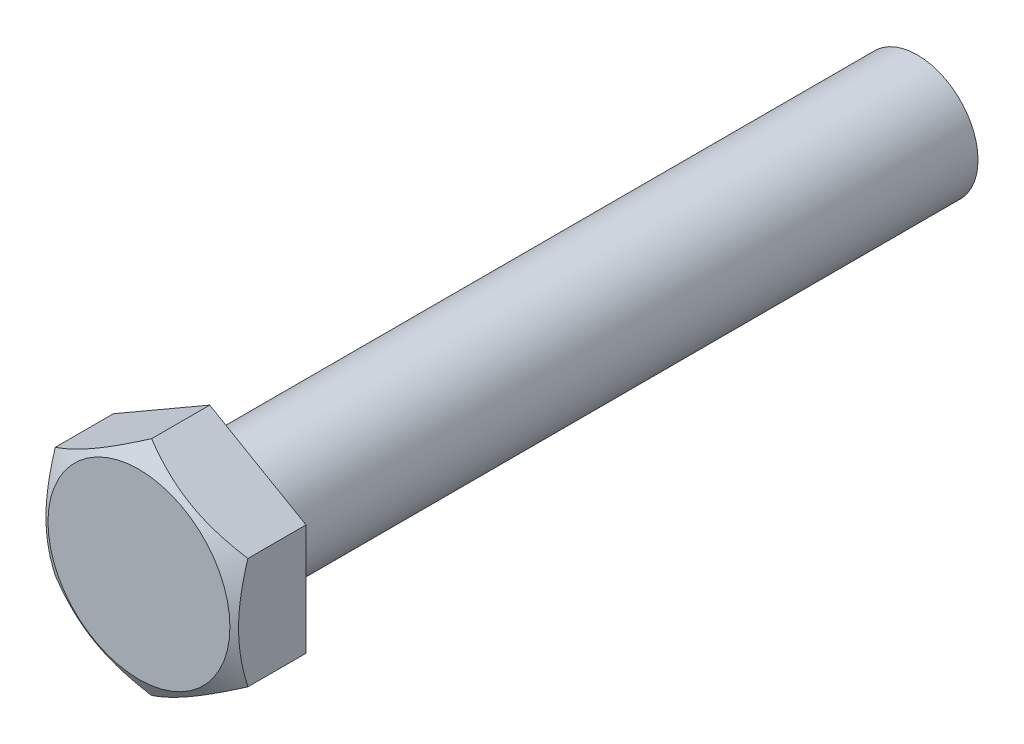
ISO-10303-21;
HEADER;
FILE_DESCRIPTION(('STEP AP214'),'2;1');
FILE_NAME('part.step','',(''),(''),'','','');
FILE_SCHEMA(('AUTOMOTIVE_DESIGN { 1 0 10303 214 1 1 1 1 }'));
ENDSEC;
DATA;
#1=APPLICATION_CONTEXT('core data for automotive mechanical design processes');
#2=APPLICATION_PROTOCOL_DEFINITION('international standard','automotive_design',2000,#1);
#3=PRODUCT_CONTEXT('',#1,'mechanical');
#4=PRODUCT('Part','Part','',(#3));
#5=PRODUCT_RELATED_PRODUCT_CATEGORY('part','',(#4));
#6=PRODUCT_DEFINITION_FORMATION('','',#4);
#7=PRODUCT_DEFINITION_CONTEXT('part definition',#1,'design');
#8=PRODUCT_DEFINITION('design','',#6,#7);
#9=PRODUCT_DEFINITION_SHAPE('','',#8);
#10=(LENGTH_UNIT() NAMED_UNIT(*) SI_UNIT(.MILLI.,.METRE.));
#11=(NAMED_UNIT(*) PLANE_ANGLE_UNIT() SI_UNIT($,.RADIAN.));
#12=(NAMED_UNIT(*) SI_UNIT($,.STERADIAN.) SOLID_ANGLE_UNIT());
#13=UNCERTAINTY_MEASURE_WITH_UNIT(LENGTH_MEASURE(1.E-05),#10,'distance_accuracy_value','');
#14=(GEOMETRIC_REPRESENTATION_CONTEXT(3) GLOBAL_UNCERTAINTY_ASSIGNED_CONTEXT((#13)) GLOBAL_UNIT_ASSIGNED_CONTEXT((#10,
#11,#12)) REPRESENTATION_CONTEXT('',''));
#15=CARTESIAN_POINT('',(0.,0.,0.));
#16=DIRECTION('',(0.,0.,1.));
#17=DIRECTION('',(1.,0.,0.));
#18=AXIS2_PLACEMENT_3D('',#15,#16,#17);
#19=CARTESIAN_POINT('',(-4.76313972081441,8.25,-3.5));
#20=DIRECTION('',(0.,0.,-1.));
#21=DIRECTION('',(-1.,0.,0.));
#22=AXIS2_PLACEMENT_3D('',#19,#20,#21);
#23=PLANE('',#22);
#24=DIRECTION('',(0.,-1.,0.));
#25=VECTOR('',#24,1.);
#26=CARTESIAN_POINT('',(-4.76313972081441,2.75,-3.5));
#27=LINE('',#26,#25);
#28=CARTESIAN_POINT('',(-4.76313972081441,2.75,-3.5));
#29=VERTEX_POINT('',#28);
#30=CARTESIAN_POINT('',(-4.76313972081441,-2.75,-3.5));
#31=VERTEX_POINT('',#30);
#32=EDGE_CURVE('E122',#29,#31,#27,.T.);
#33=ORIENTED_EDGE('',*,*,#32,.F.);
#34=DIRECTION('',(-0.866025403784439,-0.5,0.));
#35=VECTOR('',#34,1.);
#36=CARTESIAN_POINT('',(0.,5.5,-3.5));
#37=LINE('',#36,#35);
#38=CARTESIAN_POINT('',(0.,5.5,-3.5));
#39=VERTEX_POINT('',#38);
#40=EDGE_CURVE('E105',#39,#29,#37,.T.);
#41=ORIENTED_EDGE('',*,*,#40,.F.);
#42=DIRECTION('',(-0.866025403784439,0.5,0.));
#43=VECTOR('',#42,1.);
#44=CARTESIAN_POINT('',(4.76313972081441,2.75,-3.5));
#45=LINE('',#44,#43);
#46=CARTESIAN_POINT('',(4.76313972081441,2.75,-3.5));
#47=VERTEX_POINT('',#46);
#48=EDGE_CURVE('E113',#47,#39,#45,.T.);
#49=ORIENTED_EDGE('',*,*,#48,.F.);
#50=DIRECTION('',(0.,1.,0.));
#51=VECTOR('',#50,1.);
#52=CARTESIAN_POINT('',(4.76313972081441,-2.75,-3.5));
#53=LINE('',#52,#51);
#54=CARTESIAN_POINT('',(4.76313972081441,-2.75,-3.5));
#55=VERTEX_POINT('',#54);
#56=EDGE_CURVE('E116',#55,#47,#53,.T.);
#57=ORIENTED_EDGE('',*,*,#56,.F.);
#58=DIRECTION('',(0.866025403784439,0.5,0.));
#59=VECTOR('',#58,1.);
#60=CARTESIAN_POINT('',(0.,-5.5,-3.5));
#61=LINE('',#60,#59);
#62=CARTESIAN_POINT('',(0.,-5.5,-3.5));
#63=VERTEX_POINT('',#62);
#64=EDGE_CURVE('E119',#63,#55,#61,.T.);
#65=ORIENTED_EDGE('',*,*,#64,.F.);
#66=DIRECTION('',(0.866025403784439,-0.5,0.));
#67=VECTOR('',#66,1.);
#68=CARTESIAN_POINT('',(-4.76313972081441,-2.75,-3.5));
#69=LINE('',#68,#67);
#70=EDGE_CURVE('E102',#31,#63,#69,.T.);
#71=ORIENTED_EDGE('',*,*,#70,.F.);
#72=EDGE_LOOP('',(#33,#41,#49,#57,#65,#71));
#73=FACE_BOUND('',#72,.T.);
#74=CARTESIAN_POINT('',(0.,0.,-3.5));
#75=DIRECTION('',(0.,0.,-1.));
#76=DIRECTION('',(-1.,0.,0.));
#77=AXIS2_PLACEMENT_3D('',#74,#75,#76);
#78=CIRCLE('',#77,3.);
#79=CARTESIAN_POINT('',(-3.,0.,-3.5));
#80=VERTEX_POINT('',#79);
#81=EDGE_CURVE('E194',#80,#80,#78,.T.);
#82=ORIENTED_EDGE('',*,*,#81,.F.);
#83=EDGE_LOOP('',(#82));
#84=FACE_BOUND('',#83,.T.);
#85=ADVANCED_FACE('F28',(#73,#84),#23,.T.);
#86=CARTESIAN_POINT('',(-4.76313972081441,2.75,-3.5));
#87=DIRECTION('',(-1.,0.,0.));
#88=DIRECTION('',(0.,-1.,0.));
#89=AXIS2_PLACEMENT_3D('',#86,#87,#88);
#90=PLANE('',#89);
#91=DIRECTION('',(0.,0.,1.));
#92=VECTOR('',#91,1.);
#93=CARTESIAN_POINT('',(-4.76313972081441,-2.75,-3.5));
#94=LINE('',#93,#92);
#95=CARTESIAN_POINT('',(-4.76313972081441,-2.75,-0.624869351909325));
#96=VERTEX_POINT('',#95);
#97=EDGE_CURVE('E32',#31,#96,#94,.T.);
#98=ORIENTED_EDGE('',*,*,#97,.T.);
#99=CARTESIAN_POINT('',(-4.76313972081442,-7.09569158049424,-2.52830266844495));
#100=CARTESIAN_POINT('',(-4.76313972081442,-6.89685653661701,-2.42517227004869));
#101=CARTESIAN_POINT('',(-4.76313972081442,-6.69748612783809,-2.32305587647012));
#102=CARTESIAN_POINT('',(-4.76313972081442,-6.29739710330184,-2.12141142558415));
#103=CARTESIAN_POINT('',(-4.76313972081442,-6.0966782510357,-2.02188383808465));
#104=CARTESIAN_POINT('',(-4.76313972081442,-5.69244594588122,-1.8254120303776));
#105=CARTESIAN_POINT('',(-4.76313972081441,-5.48892289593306,-1.72848748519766));
#106=CARTESIAN_POINT('',(-4.76313972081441,-5.08000464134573,-1.53868621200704));
#107=CARTESIAN_POINT('',(-4.76313972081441,-4.87460953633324,-1.44580927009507));
#108=CARTESIAN_POINT('',(-4.76313972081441,-4.45463023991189,-1.26211987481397));
#109=CARTESIAN_POINT('',(-4.76313972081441,-4.2399693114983,-1.1714818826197));
#110=CARTESIAN_POINT('',(-4.76313972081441,-3.80777597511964,-0.997198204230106));
#111=CARTESIAN_POINT('',(-4.76313972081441,-3.5902432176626,-0.913553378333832));
#112=CARTESIAN_POINT('',(-4.76313972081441,-3.15238226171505,-0.755492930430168));
#113=CARTESIAN_POINT('',(-4.76313972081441,-2.93206165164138,-0.68105650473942));
#114=CARTESIAN_POINT('',(-4.76313972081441,-2.48786571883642,-0.543801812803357));
#115=CARTESIAN_POINT('',(-4.76313972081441,-2.26399165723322,-0.48097952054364));
#116=CARTESIAN_POINT('',(-4.76313972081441,-1.80549186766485,-0.368271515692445));
#117=CARTESIAN_POINT('',(-4.76313972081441,-1.57074899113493,-0.318852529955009));
#118=CARTESIAN_POINT('',(-4.76313972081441,-1.09798717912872,-0.239178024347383));
#119=CARTESIAN_POINT('',(-4.76313972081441,-0.859968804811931,-0.208919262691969));
#120=CARTESIAN_POINT('',(-4.76313972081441,-0.385539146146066,-0.17059847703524));
#121=CARTESIAN_POINT('',(-4.76313972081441,-0.149153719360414,-0.162224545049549));
#122=CARTESIAN_POINT('',(-4.76313972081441,0.323395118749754,-0.167626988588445));
#123=CARTESIAN_POINT('',(-4.76313972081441,0.559558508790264,-0.181405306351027));
#124=CARTESIAN_POINT('',(-4.76313972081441,0.947567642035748,-0.221278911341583));
#125=CARTESIAN_POINT('',(-4.76313972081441,1.10006619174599,-0.241394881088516));
#126=CARTESIAN_POINT('',(-4.76313972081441,1.40379680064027,-0.289643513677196));
#127=CARTESIAN_POINT('',(-4.76313972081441,1.55502871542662,-0.317777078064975));
#128=CARTESIAN_POINT('',(-4.76313972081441,2.00662578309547,-0.412899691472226));
#129=CARTESIAN_POINT('',(-4.76313972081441,2.30475985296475,-0.490595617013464));
#130=CARTESIAN_POINT('',(-4.76313972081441,2.75035296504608,-0.623984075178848));
#131=CARTESIAN_POINT('',(-4.76313972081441,2.90027297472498,-0.671884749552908));
#132=CARTESIAN_POINT('',(-4.76313972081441,3.19854601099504,-0.772378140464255));
#133=CARTESIAN_POINT('',(-4.76313972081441,3.34689902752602,-0.824970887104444));
#134=CARTESIAN_POINT('',(-4.76313972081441,3.64208992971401,-0.934082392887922));
#135=CARTESIAN_POINT('',(-4.76313972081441,3.78892826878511,-0.990599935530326));
#136=CARTESIAN_POINT('',(-4.76313972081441,4.08127878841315,-1.10695272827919));
#137=CARTESIAN_POINT('',(-4.76313972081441,4.22679098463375,-1.1667879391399));
#138=CARTESIAN_POINT('',(-4.76313972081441,4.57522928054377,-1.31401031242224));
#139=CARTESIAN_POINT('',(-4.76313972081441,4.77758075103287,-1.40275551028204));
#140=CARTESIAN_POINT('',(-4.76313972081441,5.18032096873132,-1.58460533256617));
#141=CARTESIAN_POINT('',(-4.76313972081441,5.38070957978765,-1.67771025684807));
#142=CARTESIAN_POINT('',(-4.76313972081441,5.77987499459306,-1.86742310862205));
#143=CARTESIAN_POINT('',(-4.76313972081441,5.97865140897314,-1.96403185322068));
#144=CARTESIAN_POINT('',(-4.76313972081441,6.37481212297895,-2.16006704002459));
#145=CARTESIAN_POINT('',(-4.76313972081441,6.57219638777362,-2.25949355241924));
#146=CARTESIAN_POINT('',(-4.76313972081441,7.16305919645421,-2.56142694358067));
#147=CARTESIAN_POINT('',(-4.76313972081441,7.55478380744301,-2.76736400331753));
#148=CARTESIAN_POINT('',(-4.76313972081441,8.3348948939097,-3.18546546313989));
#149=CARTESIAN_POINT('',(-4.76313972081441,8.72328122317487,-3.39763013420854));
#150=CARTESIAN_POINT('',(-4.76313972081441,9.28697559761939,-3.70978414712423));
#151=CARTESIAN_POINT('',(-4.76313972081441,9.46326278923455,-3.80801086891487));
#152=CARTESIAN_POINT('',(-4.76313972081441,9.81538100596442,-4.00526964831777));
#153=CARTESIAN_POINT('',(-4.76313972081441,9.99121204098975,-4.10430168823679));
#154=CARTESIAN_POINT('',(-4.76313972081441,10.5181292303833,-4.40245541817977));
#155=CARTESIAN_POINT('',(-4.76313972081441,10.8686223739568,-4.60262522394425));
#156=CARTESIAN_POINT('',(-4.76313972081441,11.5673553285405,-5.00451636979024));
#157=CARTESIAN_POINT('',(-4.76313972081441,11.9155987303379,-5.20623147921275));
#158=CARTESIAN_POINT('',(-4.76313972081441,12.6110754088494,-5.61134525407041));
#159=CARTESIAN_POINT('',(-4.76313972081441,12.9583087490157,-5.81474381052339));
#160=CARTESIAN_POINT('',(-4.76313972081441,13.3051670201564,-6.01877576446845));
#161=B_SPLINE_CURVE_WITH_KNOTS('',3,(#99,#100,#101,#102,#103,#104,#105,#106,#107,#108,#109,#110,
#111,#112,#113,#114,#115,#116,#117,#118,#119,#120,#121,#122,#123,#124,#125,#126,#127,#128,#129,
#130,#131,#132,#133,#134,#135,#136,#137,#138,#139,#140,#141,#142,#143,#144,#145,#146,#147,#148,
#149,#150,#151,#152,#153,#154,#155,#156,#157,#158,#159,#160),.UNSPECIFIED.,.F.,.F.,(4,2,2,2,2,2,
2,2,2,2,2,2,2,2,2,2,2,2,2,2,2,2,2,2,2,2,2,2,2,2,4),(0.,0.671977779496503,1.34407666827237,
2.02031301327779,2.69651357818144,3.39545401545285,4.09448031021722,4.79189734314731,
5.48907216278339,6.20807952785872,6.92696520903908,7.63554783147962,8.34419258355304,
8.80544012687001,9.26673955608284,10.1897364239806,10.6618533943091,11.1339733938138,
11.6059477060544,12.0779164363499,12.7407167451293,13.4035627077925,14.0665642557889,
14.7295823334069,16.0571632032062,17.3848019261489,17.9902182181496,18.5956212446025,
19.8064859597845,21.0138178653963,22.2210722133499),.UNSPECIFIED.);
#162=CARTESIAN_POINT('',(-4.76313972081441,2.75,-0.624869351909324));
#163=VERTEX_POINT('',#162);
#164=EDGE_CURVE('E45',#96,#163,#161,.T.);
#165=ORIENTED_EDGE('',*,*,#164,.T.);
#166=DIRECTION('',(0.,0.,1.));
#167=VECTOR('',#166,1.);
#168=CARTESIAN_POINT('',(-4.76313972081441,2.75,-3.5));
#169=LINE('',#168,#167);
#170=EDGE_CURVE('E11',#29,#163,#169,.T.);
#171=ORIENTED_EDGE('',*,*,#170,.F.);
#172=ORIENTED_EDGE('',*,*,#32,.T.);
#173=EDGE_LOOP('',(#98,#165,#171,#172));
#174=FACE_BOUND('',#173,.T.);
#175=ADVANCED_FACE('F135',(#174),#90,.T.);
#176=CARTESIAN_POINT('',(0.,5.5,-3.5));
#177=DIRECTION('',(-0.5,0.866025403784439,0.));
#178=DIRECTION('',(-0.866025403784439,-0.5,0.));
#179=AXIS2_PLACEMENT_3D('',#176,#177,#178);
#180=PLANE('',#179);
#181=ORIENTED_EDGE('',*,*,#170,.T.);
#182=CARTESIAN_POINT('',(-4.76333972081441,2.74988452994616,-0.624941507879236));
#183=CARTESIAN_POINT('',(-4.55251955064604,2.87160161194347,-0.548840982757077));
#184=CARTESIAN_POINT('',(-4.33950931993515,2.99458312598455,-0.479574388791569));
#185=CARTESIAN_POINT('',(-3.90913901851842,3.24305753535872,-0.358740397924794));
#186=CARTESIAN_POINT('',(-3.69176806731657,3.36855671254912,-0.307225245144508));
#187=CARTESIAN_POINT('',(-3.36654567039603,3.55632395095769,-0.247201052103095));
#188=CARTESIAN_POINT('',(-3.25987155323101,3.61791228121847,-0.230200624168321));
#189=CARTESIAN_POINT('',(-3.04596944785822,3.74140871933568,-0.20183412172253));
#190=CARTESIAN_POINT('',(-2.93874151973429,3.80331679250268,-0.190467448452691));
#191=CARTESIAN_POINT('',(-2.72408332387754,3.92724975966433,-0.173679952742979));
#192=CARTESIAN_POINT('',(-2.61665354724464,3.98927437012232,-0.168250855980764));
#193=CARTESIAN_POINT('',(-2.4017017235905,4.11337686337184,-0.163452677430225));
#194=CARTESIAN_POINT('',(-2.2941796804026,4.17545474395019,-0.16408335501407));
#195=CARTESIAN_POINT('',(-2.00341086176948,4.34333019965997,-0.17399553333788));
#196=CARTESIAN_POINT('',(-1.82029190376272,4.4490539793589,-0.189069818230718));
#197=CARTESIAN_POINT('',(-1.45549029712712,4.65967228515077,-0.235752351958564));
#198=CARTESIAN_POINT('',(-1.27380944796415,4.76456577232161,-0.267378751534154));
#199=CARTESIAN_POINT('',(-0.908197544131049,4.97565190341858,-0.34601264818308));
#200=CARTESIAN_POINT('',(-0.724328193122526,5.08180892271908,-0.393393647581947));
#201=CARTESIAN_POINT('',(-0.359750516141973,5.29229794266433,-0.500541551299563));
#202=CARTESIAN_POINT('',(-0.179035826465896,5.39663361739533,-0.560279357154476));
#203=CARTESIAN_POINT('',(0.00019999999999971,5.50011547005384,-0.624941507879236));
#204=B_SPLINE_CURVE_WITH_KNOTS('',3,(#182,#183,#184,#185,#186,#187,#188,#189,#190,#191,#192,
#193,#194,#195,#196,#197,#198,#199,#200,#201,#202,#203),.UNSPECIFIED.,.F.,.F.,(4,2,2,2,2,2,2,2,
2,2,4),(0.,0.765657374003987,1.53354927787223,1.90646310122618,2.27933728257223,2.6516911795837,
3.02403029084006,3.65922428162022,4.29511627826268,4.94730896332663,5.59798296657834),.UNSPECIFIED.);
#205=CARTESIAN_POINT('',(0.,5.5,-0.624869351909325));
#206=VERTEX_POINT('',#205);
#207=EDGE_CURVE('E129',#163,#206,#204,.T.);
#208=ORIENTED_EDGE('',*,*,#207,.T.);
#209=DIRECTION('',(0.,0.,1.));
#210=VECTOR('',#209,1.);
#211=CARTESIAN_POINT('',(0.,5.5,-3.5));
#212=LINE('',#211,#210);
#213=EDGE_CURVE('E37',#39,#206,#212,.T.);
#214=ORIENTED_EDGE('',*,*,#213,.F.);
#215=ORIENTED_EDGE('',*,*,#40,.T.);
#216=EDGE_LOOP('',(#181,#208,#214,#215));
#217=FACE_BOUND('',#216,.T.);
#218=ADVANCED_FACE('F173',(#217),#180,.T.);
#219=CARTESIAN_POINT('',(4.76313972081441,2.75,-3.5));
#220=DIRECTION('',(0.5,0.866025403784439,0.));
#221=DIRECTION('',(-0.866025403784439,0.5,0.));
#222=AXIS2_PLACEMENT_3D('',#219,#220,#221);
#223=PLANE('',#222);
#224=ORIENTED_EDGE('',*,*,#213,.T.);
#225=CARTESIAN_POINT('',(-0.00020000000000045,5.50011547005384,-0.624941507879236));
#226=CARTESIAN_POINT('',(0.210620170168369,5.37839838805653,-0.548840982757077));
#227=CARTESIAN_POINT('',(0.423630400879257,5.25541687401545,-0.479574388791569));
#228=CARTESIAN_POINT('',(0.854000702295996,5.00694246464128,-0.358740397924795));
#229=CARTESIAN_POINT('',(1.07137165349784,4.88144328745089,-0.307225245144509));
#230=CARTESIAN_POINT('',(1.39659405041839,4.69367604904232,-0.247201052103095));
#231=CARTESIAN_POINT('',(1.5032681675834,4.63208771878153,-0.230200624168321));
#232=CARTESIAN_POINT('',(1.71717027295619,4.50859128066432,-0.20183412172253));
#233=CARTESIAN_POINT('',(1.82439820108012,4.44668320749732,-0.190467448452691));
#234=CARTESIAN_POINT('',(2.03905639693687,4.32275024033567,-0.173679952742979));
#235=CARTESIAN_POINT('',(2.14648617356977,4.26072562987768,-0.168250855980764));
#236=CARTESIAN_POINT('',(2.36143799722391,4.13662313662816,-0.163452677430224));
#237=CARTESIAN_POINT('',(2.46896004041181,4.07454525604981,-0.16408335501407));
#238=CARTESIAN_POINT('',(2.75972885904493,3.90666980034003,-0.173995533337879));
#239=CARTESIAN_POINT('',(2.94284781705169,3.8009460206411,-0.189069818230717));
#240=CARTESIAN_POINT('',(3.30764942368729,3.59032771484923,-0.235752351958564));
#241=CARTESIAN_POINT('',(3.48933027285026,3.48543422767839,-0.267378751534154));
#242=CARTESIAN_POINT('',(3.85494217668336,3.27434809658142,-0.34601264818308));
#243=CARTESIAN_POINT('',(4.03881152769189,3.16819107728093,-0.393393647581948));
#244=CARTESIAN_POINT('',(4.40338920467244,2.95770205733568,-0.500541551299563));
#245=CARTESIAN_POINT('',(4.58410389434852,2.85336638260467,-0.560279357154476));
#246=CARTESIAN_POINT('',(4.76333972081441,2.74988452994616,-0.624941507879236));
#247=B_SPLINE_CURVE_WITH_KNOTS('',3,(#225,#226,#227,#228,#229,#230,#231,#232,#233,#234,#235,
#236,#237,#238,#239,#240,#241,#242,#243,#244,#245,#246),.UNSPECIFIED.,.F.,.F.,(4,2,2,2,2,2,2,2,
2,2,4),(0.,0.765657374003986,1.53354927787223,1.90646310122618,2.27933728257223,2.6516911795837,
3.02403029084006,3.65922428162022,4.29511627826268,4.94730896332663,5.59798296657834),.UNSPECIFIED.);
#248=CARTESIAN_POINT('',(4.76313972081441,2.75,-0.624869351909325));
#249=VERTEX_POINT('',#248);
#250=EDGE_CURVE('E163',#206,#249,#247,.T.);
#251=ORIENTED_EDGE('',*,*,#250,.T.);
#252=DIRECTION('',(0.,0.,1.));
#253=VECTOR('',#252,1.);
#254=CARTESIAN_POINT('',(4.76313972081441,2.75,-3.5));
#255=LINE('',#254,#253);
#256=EDGE_CURVE('E103',#47,#249,#255,.T.);
#257=ORIENTED_EDGE('',*,*,#256,.F.);
#258=ORIENTED_EDGE('',*,*,#48,.T.);
#259=EDGE_LOOP('',(#224,#251,#257,#258));
#260=FACE_BOUND('',#259,.T.);
#261=ADVANCED_FACE('F169',(#260),#223,.T.);
#262=CARTESIAN_POINT('',(4.76313972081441,-2.75,-3.5));
#263=DIRECTION('',(1.,0.,0.));
#264=DIRECTION('',(0.,0.,-1.));
#265=AXIS2_PLACEMENT_3D('',#262,#263,#264);
#266=PLANE('',#265);
#267=ORIENTED_EDGE('',*,*,#256,.T.);
#268=CARTESIAN_POINT('',(4.76313972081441,-7.0956915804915,-2.52830266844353));
#269=CARTESIAN_POINT('',(4.76313972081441,-6.89685653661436,-2.42517227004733));
#270=CARTESIAN_POINT('',(4.76313972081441,-6.69748612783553,-2.32305587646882));
#271=CARTESIAN_POINT('',(4.76313972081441,-6.29739710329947,-2.12141142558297));
#272=CARTESIAN_POINT('',(4.76313972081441,-6.09667825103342,-2.02188383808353));
#273=CARTESIAN_POINT('',(4.76313972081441,-5.69244594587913,-1.82541203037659));
#274=CARTESIAN_POINT('',(4.76313972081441,-5.48892289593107,-1.72848748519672));
#275=CARTESIAN_POINT('',(4.76313972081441,-5.08000464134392,-1.53868621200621));
#276=CARTESIAN_POINT('',(4.76313972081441,-4.87460953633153,-1.4458092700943));
#277=CARTESIAN_POINT('',(4.76313972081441,-4.45463023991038,-1.26211987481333));
#278=CARTESIAN_POINT('',(4.76313972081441,-4.23996931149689,-1.17148188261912));
#279=CARTESIAN_POINT('',(4.76313972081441,-3.80777597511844,-0.997198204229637));
#280=CARTESIAN_POINT('',(4.76313972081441,-3.59024321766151,-0.91355337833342));
#281=CARTESIAN_POINT('',(4.76313972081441,-3.15238226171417,-0.755492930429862));
#282=CARTESIAN_POINT('',(4.76313972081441,-2.9320616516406,-0.681056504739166));
#283=CARTESIAN_POINT('',(4.76313972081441,-2.48786571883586,-0.543801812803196));
#284=CARTESIAN_POINT('',(4.76313972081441,-2.26399165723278,-0.480979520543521));
#285=CARTESIAN_POINT('',(4.76313972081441,-1.80549186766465,-0.368271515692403));
#286=CARTESIAN_POINT('',(4.76313972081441,-1.57074899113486,-0.318852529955));
#287=CARTESIAN_POINT('',(4.76313972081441,-1.09798717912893,-0.239178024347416));
#288=CARTESIAN_POINT('',(4.76313972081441,-0.859968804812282,-0.208919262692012));
#289=CARTESIAN_POINT('',(4.76313972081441,-0.385539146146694,-0.170598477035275));
#290=CARTESIAN_POINT('',(4.76313972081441,-0.149153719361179,-0.162224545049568));
#291=CARTESIAN_POINT('',(4.76313972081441,0.323395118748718,-0.167626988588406));
#292=CARTESIAN_POINT('',(4.76313972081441,0.559558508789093,-0.181405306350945));
#293=CARTESIAN_POINT('',(4.76313972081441,0.947567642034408,-0.22127891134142));
#294=CARTESIAN_POINT('',(4.76313972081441,1.10006619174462,-0.241394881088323));
#295=CARTESIAN_POINT('',(4.76313972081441,1.40379680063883,-0.28964351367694));
#296=CARTESIAN_POINT('',(4.76313972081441,1.55502871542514,-0.317777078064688));
#297=CARTESIAN_POINT('',(4.76313972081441,2.00662578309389,-0.412899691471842));
#298=CARTESIAN_POINT('',(4.76313972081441,2.30475985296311,-0.490595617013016));
#299=CARTESIAN_POINT('',(4.76313972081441,2.75035296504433,-0.623984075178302));
#300=CARTESIAN_POINT('',(4.76313972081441,2.9002729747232,-0.671884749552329));
#301=CARTESIAN_POINT('',(4.76313972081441,3.19854601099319,-0.772378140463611));
#302=CARTESIAN_POINT('',(4.76313972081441,3.34689902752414,-0.82497088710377));
#303=CARTESIAN_POINT('',(4.76313972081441,3.64208992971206,-0.934082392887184));
#304=CARTESIAN_POINT('',(4.76313972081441,3.78892826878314,-0.990599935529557));
#305=CARTESIAN_POINT('',(4.76313972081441,4.08127878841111,-1.10695272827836));
#306=CARTESIAN_POINT('',(4.76313972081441,4.22679098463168,-1.16678793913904));
#307=CARTESIAN_POINT('',(4.76313972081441,4.57522928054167,-1.31401031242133));
#308=CARTESIAN_POINT('',(4.76313972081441,4.77758075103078,-1.40275551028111));
#309=CARTESIAN_POINT('',(4.76313972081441,5.18032096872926,-1.58460533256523));
#310=CARTESIAN_POINT('',(4.76313972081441,5.3807095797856,-1.67771025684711));
#311=CARTESIAN_POINT('',(4.76313972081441,5.77987499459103,-1.86742310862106));
#312=CARTESIAN_POINT('',(4.76313972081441,5.97865140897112,-1.96403185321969));
#313=CARTESIAN_POINT('',(4.76313972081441,6.37481212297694,-2.16006704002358));
#314=CARTESIAN_POINT('',(4.76313972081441,6.57219638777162,-2.25949355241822));
#315=CARTESIAN_POINT('',(4.76313972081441,7.16305919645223,-2.56142694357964));
#316=CARTESIAN_POINT('',(4.76313972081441,7.55478380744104,-2.76736400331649));
#317=CARTESIAN_POINT('',(4.76313972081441,8.33489489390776,-3.18546546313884));
#318=CARTESIAN_POINT('',(4.76313972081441,8.72328122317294,-3.39763013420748));
#319=CARTESIAN_POINT('',(4.76313972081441,9.28697559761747,-3.70978414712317));
#320=CARTESIAN_POINT('',(4.76313972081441,9.46326278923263,-3.8080108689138));
#321=CARTESIAN_POINT('',(4.76313972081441,9.8153810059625,-4.00526964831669));
#322=CARTESIAN_POINT('',(4.76313972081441,9.99121204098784,-4.10430168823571));
#323=CARTESIAN_POINT('',(4.76313972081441,10.5181292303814,-4.40245541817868));
#324=CARTESIAN_POINT('',(4.76313972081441,10.8686223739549,-4.60262522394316));
#325=CARTESIAN_POINT('',(4.76313972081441,11.5673553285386,-5.00451636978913));
#326=CARTESIAN_POINT('',(4.76313972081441,11.915598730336,-5.20623147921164));
#327=CARTESIAN_POINT('',(4.76313972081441,12.6110754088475,-5.61134525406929));
#328=CARTESIAN_POINT('',(4.76313972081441,12.9583087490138,-5.81474381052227));
#329=CARTESIAN_POINT('',(4.76313972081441,13.3051670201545,-6.01877576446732));
#330=B_SPLINE_CURVE_WITH_KNOTS('',3,(#268,#269,#270,#271,#272,#273,#274,#275,#276,#277,#278,
#279,#280,#281,#282,#283,#284,#285,#286,#287,#288,#289,#290,#291,#292,#293,#294,#295,#296,#297,
#298,#299,#300,#301,#302,#303,#304,#305,#306,#307,#308,#309,#310,#311,#312,#313,#314,#315,#316,
#317,#318,#319,#320,#321,#322,#323,#324,#325,#326,#327,#328,#329),.UNSPECIFIED.,.F.,.F.,(4,2,2,
2,2,2,2,2,2,2,2,2,2,2,2,2,2,2,2,2,2,2,2,2,2,2,2,2,2,2,4),(0.,0.671977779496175,1.34407666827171,
2.0203130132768,2.69651357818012,3.39545401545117,4.09448031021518,4.79189734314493,
5.48907216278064,6.20807952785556,6.9269652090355,7.63554783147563,8.34419258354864,
8.80544012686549,9.2667395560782,10.1897364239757,10.6618533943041,11.1339733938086,
11.6059477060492,12.0779164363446,12.7407167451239,13.4035627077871,14.0665642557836,
14.7295823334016,16.0571632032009,17.3848019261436,17.9902182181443,18.5956212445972,
19.8064859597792,21.013817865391,22.2210722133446),.UNSPECIFIED.);
#331=CARTESIAN_POINT('',(4.76313972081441,-2.75,-0.624869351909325));
#332=VERTEX_POINT('',#331);
#333=EDGE_CURVE('E97',#249,#332,#330,.F.);
#334=ORIENTED_EDGE('',*,*,#333,.T.);
#335=DIRECTION('',(0.,0.,1.));
#336=VECTOR('',#335,1.);
#337=CARTESIAN_POINT('',(4.76313972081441,-2.75,-3.5));
#338=LINE('',#337,#336);
#339=EDGE_CURVE('E96',#55,#332,#338,.T.);
#340=ORIENTED_EDGE('',*,*,#339,.F.);
#341=ORIENTED_EDGE('',*,*,#56,.T.);
#342=EDGE_LOOP('',(#267,#334,#340,#341));
#343=FACE_BOUND('',#342,.T.);
#344=ADVANCED_FACE('F172',(#343),#266,.T.);
#345=CARTESIAN_POINT('',(0.,-5.5,-3.5));
#346=DIRECTION('',(0.5,-0.866025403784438,0.));
#347=DIRECTION('',(0.866025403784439,0.5,0.));
#348=AXIS2_PLACEMENT_3D('',#345,#346,#347);
#349=PLANE('',#348);
#350=ORIENTED_EDGE('',*,*,#339,.T.);
#351=CARTESIAN_POINT('',(4.76333972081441,-2.74988452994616,-0.624941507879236));
#352=CARTESIAN_POINT('',(4.55251955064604,-2.87160161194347,-0.548840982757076));
#353=CARTESIAN_POINT('',(4.33950931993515,-2.99458312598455,-0.479574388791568));
#354=CARTESIAN_POINT('',(3.90913901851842,-3.24305753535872,-0.358740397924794));
#355=CARTESIAN_POINT('',(3.69176806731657,-3.36855671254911,-0.307225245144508));
#356=CARTESIAN_POINT('',(3.36654567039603,-3.55632395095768,-0.247201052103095));
#357=CARTESIAN_POINT('',(3.25987155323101,-3.61791228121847,-0.23020062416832));
#358=CARTESIAN_POINT('',(3.04596944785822,-3.74140871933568,-0.20183412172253));
#359=CARTESIAN_POINT('',(2.93874151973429,-3.80331679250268,-0.190467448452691));
#360=CARTESIAN_POINT('',(2.72408332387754,-3.92724975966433,-0.173679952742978));
#361=CARTESIAN_POINT('',(2.61665354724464,-3.98927437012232,-0.168250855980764));
#362=CARTESIAN_POINT('',(2.4017017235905,-4.11337686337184,-0.163452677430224));
#363=CARTESIAN_POINT('',(2.2941796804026,-4.17545474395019,-0.16408335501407));
#364=CARTESIAN_POINT('',(2.00341086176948,-4.34333019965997,-0.17399553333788));
#365=CARTESIAN_POINT('',(1.82029190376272,-4.4490539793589,-0.189069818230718));
#366=CARTESIAN_POINT('',(1.45549029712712,-4.65967228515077,-0.235752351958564));
#367=CARTESIAN_POINT('',(1.27380944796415,-4.76456577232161,-0.267378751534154));
#368=CARTESIAN_POINT('',(0.90819754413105,-4.97565190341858,-0.34601264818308));
#369=CARTESIAN_POINT('',(0.724328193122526,-5.08180892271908,-0.393393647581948));
#370=CARTESIAN_POINT('',(0.359750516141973,-5.29229794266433,-0.500541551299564));
#371=CARTESIAN_POINT('',(0.179035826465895,-5.39663361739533,-0.560279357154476));
#372=CARTESIAN_POINT('',(-0.00019999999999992,-5.50011547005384,-0.624941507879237));
#373=B_SPLINE_CURVE_WITH_KNOTS('',3,(#351,#352,#353,#354,#355,#356,#357,#358,#359,#360,#361,
#362,#363,#364,#365,#366,#367,#368,#369,#370,#371,#372),.UNSPECIFIED.,.F.,.F.,(4,2,2,2,2,2,2,2,
2,2,4),(0.,0.765657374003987,1.53354927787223,1.90646310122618,2.27933728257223,2.6516911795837,
3.02403029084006,3.65922428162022,4.29511627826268,4.94730896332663,5.59798296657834),.UNSPECIFIED.);
#374=CARTESIAN_POINT('',(0.,-5.5,-0.624869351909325));
#375=VERTEX_POINT('',#374);
#376=EDGE_CURVE('E83',#332,#375,#373,.T.);
#377=ORIENTED_EDGE('',*,*,#376,.T.);
#378=DIRECTION('',(0.,0.,1.));
#379=VECTOR('',#378,1.);
#380=CARTESIAN_POINT('',(0.,-5.5,-3.5));
#381=LINE('',#380,#379);
#382=EDGE_CURVE('E94',#63,#375,#381,.T.);
#383=ORIENTED_EDGE('',*,*,#382,.F.);
#384=ORIENTED_EDGE('',*,*,#64,.T.);
#385=EDGE_LOOP('',(#350,#377,#383,#384));
#386=FACE_BOUND('',#385,.T.);
#387=ADVANCED_FACE('F92',(#386),#349,.T.);
#388=CARTESIAN_POINT('',(-4.76313972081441,-2.75,-3.5));
#389=DIRECTION('',(-0.5,-0.866025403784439,0.));
#390=DIRECTION('',(0.866025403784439,-0.5,0.));
#391=AXIS2_PLACEMENT_3D('',#388,#389,#390);
#392=PLANE('',#391);
#393=ORIENTED_EDGE('',*,*,#382,.T.);
#394=CARTESIAN_POINT('',(0.000200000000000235,-5.50011547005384,-0.624941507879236));
#395=CARTESIAN_POINT('',(-0.210620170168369,-5.37839838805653,-0.548840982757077));
#396=CARTESIAN_POINT('',(-0.423630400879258,-5.25541687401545,-0.479574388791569));
#397=CARTESIAN_POINT('',(-0.854000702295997,-5.00694246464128,-0.358740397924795));
#398=CARTESIAN_POINT('',(-1.07137165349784,-4.88144328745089,-0.307225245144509));
#399=CARTESIAN_POINT('',(-1.39659405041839,-4.69367604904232,-0.247201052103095));
#400=CARTESIAN_POINT('',(-1.5032681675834,-4.63208771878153,-0.230200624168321));
#401=CARTESIAN_POINT('',(-1.71717027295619,-4.50859128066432,-0.20183412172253));
#402=CARTESIAN_POINT('',(-1.82439820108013,-4.44668320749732,-0.190467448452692));
#403=CARTESIAN_POINT('',(-2.03905639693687,-4.32275024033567,-0.173679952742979));
#404=CARTESIAN_POINT('',(-2.14648617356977,-4.26072562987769,-0.168250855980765));
#405=CARTESIAN_POINT('',(-2.36143799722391,-4.13662313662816,-0.163452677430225));
#406=CARTESIAN_POINT('',(-2.46896004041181,-4.07454525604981,-0.164083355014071));
#407=CARTESIAN_POINT('',(-2.75972885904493,-3.90666980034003,-0.17399553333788));
#408=CARTESIAN_POINT('',(-2.94284781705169,-3.8009460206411,-0.189069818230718));
#409=CARTESIAN_POINT('',(-3.30764942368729,-3.59032771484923,-0.235752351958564));
#410=CARTESIAN_POINT('',(-3.48933027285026,-3.48543422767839,-0.267378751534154));
#411=CARTESIAN_POINT('',(-3.85494217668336,-3.27434809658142,-0.34601264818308));
#412=CARTESIAN_POINT('',(-4.03881152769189,-3.16819107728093,-0.393393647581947));
#413=CARTESIAN_POINT('',(-4.40338920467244,-2.95770205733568,-0.500541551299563));
#414=CARTESIAN_POINT('',(-4.58410389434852,-2.85336638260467,-0.560279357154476));
#415=CARTESIAN_POINT('',(-4.76333972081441,-2.74988452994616,-0.624941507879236));
#416=B_SPLINE_CURVE_WITH_KNOTS('',3,(#394,#395,#396,#397,#398,#399,#400,#401,#402,#403,#404,
#405,#406,#407,#408,#409,#410,#411,#412,#413,#414,#415),.UNSPECIFIED.,.F.,.F.,(4,2,2,2,2,2,2,2,
2,2,4),(0.,0.765657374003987,1.53354927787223,1.90646310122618,2.27933728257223,2.6516911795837,
3.02403029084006,3.65922428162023,4.29511627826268,4.94730896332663,5.59798296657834),.UNSPECIFIED.);
#417=EDGE_CURVE('E79',#375,#96,#416,.T.);
#418=ORIENTED_EDGE('',*,*,#417,.T.);
#419=ORIENTED_EDGE('',*,*,#97,.F.);
#420=ORIENTED_EDGE('',*,*,#70,.T.);
#421=EDGE_LOOP('',(#393,#418,#419,#420));
#422=FACE_BOUND('',#421,.T.);
#423=ADVANCED_FACE('F100',(#422),#392,.T.);
#424=CARTESIAN_POINT('',(0.,0.,0.));
#425=DIRECTION('',(0.,0.,-1.));
#426=DIRECTION('',(1.,0.,0.));
#427=AXIS2_PLACEMENT_3D('',#424,#425,#426);
#428=CONICAL_SURFACE('',#427,4.5,1.01229096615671);
#429=ORIENTED_EDGE('',*,*,#417,.F.);
#430=ORIENTED_EDGE('',*,*,#376,.F.);
#431=ORIENTED_EDGE('',*,*,#333,.F.);
#432=ORIENTED_EDGE('',*,*,#250,.F.);
#433=ORIENTED_EDGE('',*,*,#207,.F.);
#434=ORIENTED_EDGE('',*,*,#164,.F.);
#435=EDGE_LOOP('',(#429,#430,#431,#432,#433,#434));
#436=FACE_BOUND('',#435,.T.);
#437=CARTESIAN_POINT('',(0.,0.,0.));
#438=DIRECTION('',(0.,0.,1.));
#439=DIRECTION('',(1.,0.,0.));
#440=AXIS2_PLACEMENT_3D('',#437,#438,#439);
#441=CIRCLE('',#440,4.5);
#442=CARTESIAN_POINT('',(4.5,0.,0.));
#443=VERTEX_POINT('',#442);
#444=EDGE_CURVE('E88',#443,#443,#441,.T.);
#445=ORIENTED_EDGE('',*,*,#444,.F.);
#446=EDGE_LOOP('',(#445));
#447=FACE_BOUND('',#446,.T.);
#448=ADVANCED_FACE('F81',(#436,#447),#428,.T.);
#449=CARTESIAN_POINT('',(-4.76313972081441,8.25,0.));
#450=DIRECTION('',(0.,0.,-1.));
#451=DIRECTION('',(-1.,0.,0.));
#452=AXIS2_PLACEMENT_3D('',#449,#450,#451);
#453=PLANE('',#452);
#454=ORIENTED_EDGE('',*,*,#444,.T.);
#455=EDGE_LOOP('',(#454));
#456=FACE_BOUND('',#455,.T.);
#457=ADVANCED_FACE('F142',(#456),#453,.F.);
#458=CARTESIAN_POINT('',(0.,0.,-38.5));
#459=DIRECTION('',(0.,0.,1.));
#460=DIRECTION('',(1.,0.,0.));
#461=AXIS2_PLACEMENT_3D('',#458,#459,#460);
#462=CYLINDRICAL_SURFACE('',#461,3.);
#463=CARTESIAN_POINT('',(0.,0.,-38.5));
#464=DIRECTION('',(0.,0.,-1.));
#465=DIRECTION('',(-1.,0.,0.));
#466=AXIS2_PLACEMENT_3D('',#463,#464,#465);
#467=CIRCLE('',#466,3.);
#468=CARTESIAN_POINT('',(-3.,0.,-38.5));
#469=VERTEX_POINT('',#468);
#470=EDGE_CURVE('E196',#469,#469,#467,.T.);
#471=ORIENTED_EDGE('',*,*,#470,.F.);
#472=EDGE_LOOP('',(#471));
#473=FACE_BOUND('',#472,.T.);
#474=ORIENTED_EDGE('',*,*,#81,.T.);
#475=EDGE_LOOP('',(#474));
#476=FACE_BOUND('',#475,.T.);
#477=ADVANCED_FACE('F143',(#473,#476),#462,.T.);
#478=CARTESIAN_POINT('',(0.,0.,-34.5));
#479=DIRECTION('',(0.,0.,1.));
#480=DIRECTION('',(1.,0.,0.));
#481=AXIS2_PLACEMENT_3D('',#478,#479,#480);
#482=SPHERICAL_SURFACE('',#481,5.);
#483=ORIENTED_EDGE('',*,*,#470,.T.);
#484=EDGE_LOOP('',(#483));
#485=FACE_BOUND('',#484,.T.);
#486=ADVANCED_FACE('F30',(#485),#482,.T.);
#487=CLOSED_SHELL('',(#85,#175,#218,#261,#344,#387,#423,#448,#457,#477,#486));
#488=MANIFOLD_SOLID_BREP('B2',#487);
#489=ADVANCED_BREP_SHAPE_REPRESENTATION('',(#18,#488),#14);
#490=SHAPE_DEFINITION_REPRESENTATION(#9,#489);
ENDSEC;
END-ISO-10303-21;
